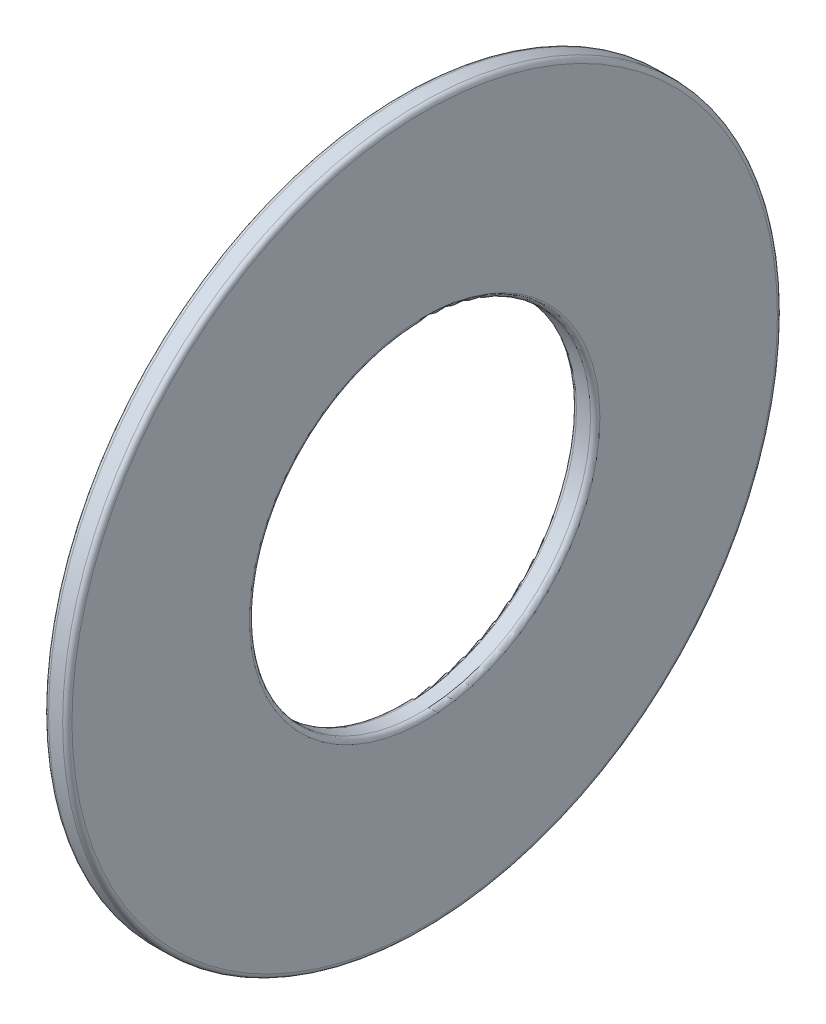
from build123d import *

# Parameters (mm, degrees)
SKETCH1_R           = 34.925
SKETCH1_R_2         = 16.6624
BOSS_EXTRUDE1_DEPTH = 1.143
FILLET1_R           = 0.4572


with BuildPart() as part:
    # Sketch1 → Boss-Extrude1 (new, symmetric)
    with BuildSketch(Plane(origin=(0, 0, 0), x_dir=(0, 0, -1), z_dir=(1, 0, 0))):
        Circle(SKETCH1_R)
        Circle(SKETCH1_R_2, mode=Mode.SUBTRACT)
    extrude(amount=BOSS_EXTRUDE1_DEPTH, both=True)

    # Fillet1
    fillet1_edges = [part.edges().sort_by_distance(p)[0] for p in [
        (-1.143, 0, 34.925),
        (1.143, 0, 34.925),
        (-1.143, 0, 16.6624),
        (1.143, 0, 16.6624),
    ]]
    fillet(fillet1_edges, radius=FILLET1_R)


solid = part.part
